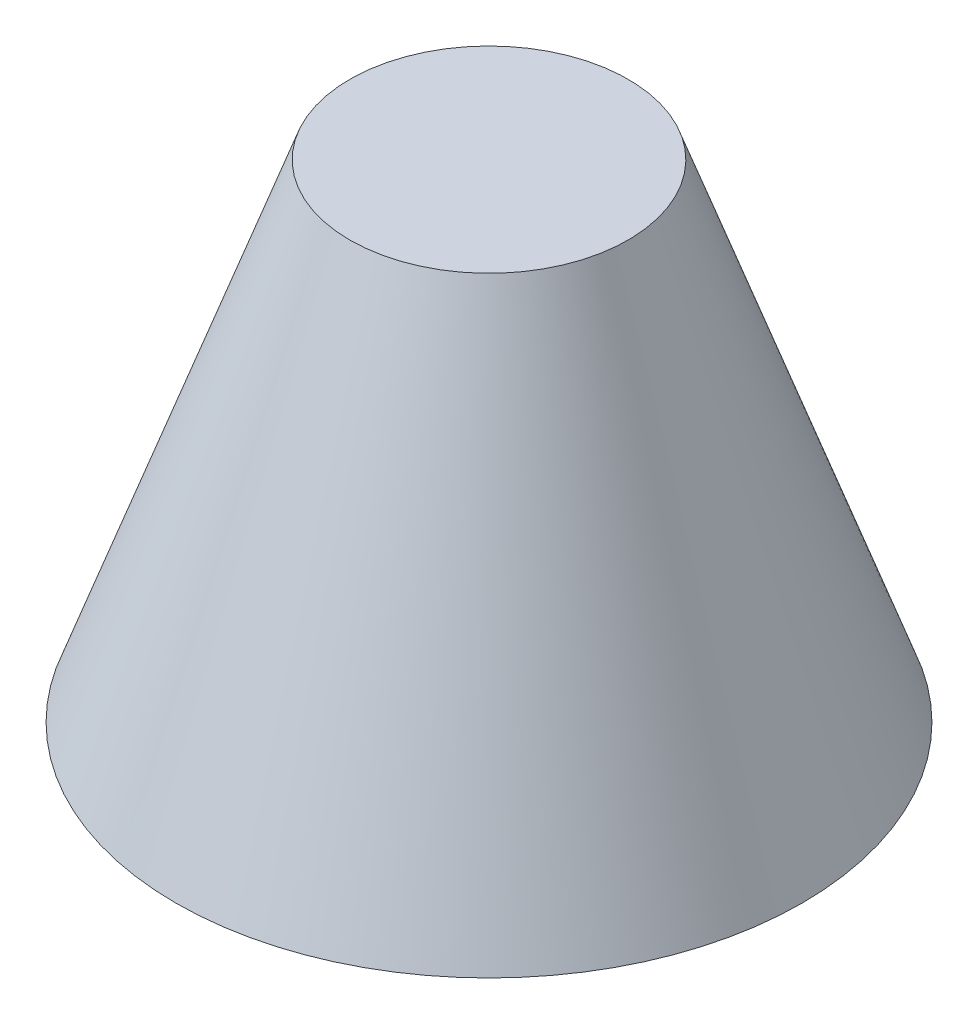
ISO-10303-21;
HEADER;
FILE_DESCRIPTION(('STEP AP214'),'2;1');
FILE_NAME('part.step','',(''),(''),'','','');
FILE_SCHEMA(('AUTOMOTIVE_DESIGN { 1 0 10303 214 1 1 1 1 }'));
ENDSEC;
DATA;
#1=APPLICATION_CONTEXT('core data for automotive mechanical design processes');
#2=APPLICATION_PROTOCOL_DEFINITION('international standard','automotive_design',2000,#1);
#3=PRODUCT_CONTEXT('',#1,'mechanical');
#4=PRODUCT('Part','Part','',(#3));
#5=PRODUCT_RELATED_PRODUCT_CATEGORY('part','',(#4));
#6=PRODUCT_DEFINITION_FORMATION('','',#4);
#7=PRODUCT_DEFINITION_CONTEXT('part definition',#1,'design');
#8=PRODUCT_DEFINITION('design','',#6,#7);
#9=PRODUCT_DEFINITION_SHAPE('','',#8);
#10=(LENGTH_UNIT() NAMED_UNIT(*) SI_UNIT(.MILLI.,.METRE.));
#11=(NAMED_UNIT(*) PLANE_ANGLE_UNIT() SI_UNIT($,.RADIAN.));
#12=(NAMED_UNIT(*) SI_UNIT($,.STERADIAN.) SOLID_ANGLE_UNIT());
#13=UNCERTAINTY_MEASURE_WITH_UNIT(LENGTH_MEASURE(1.E-05),#10,'distance_accuracy_value','');
#14=(GEOMETRIC_REPRESENTATION_CONTEXT(3) GLOBAL_UNCERTAINTY_ASSIGNED_CONTEXT((#13)) GLOBAL_UNIT_ASSIGNED_CONTEXT((#10,
#11,#12)) REPRESENTATION_CONTEXT('',''));
#15=CARTESIAN_POINT('',(0.,0.,0.));
#16=DIRECTION('',(0.,0.,1.));
#17=DIRECTION('',(1.,0.,0.));
#18=AXIS2_PLACEMENT_3D('',#15,#16,#17);
#19=CARTESIAN_POINT('',(0.,70.,0.));
#20=DIRECTION('',(0.,-1.,0.));
#21=DIRECTION('',(0.,0.,-1.));
#22=AXIS2_PLACEMENT_3D('',#19,#20,#21);
#23=PLANE('',#22);
#24=CARTESIAN_POINT('',(0.,70.,0.));
#25=DIRECTION('',(0.,1.,0.));
#26=DIRECTION('',(0.,0.,1.));
#27=AXIS2_PLACEMENT_3D('',#24,#25,#26);
#28=CIRCLE('',#27,20.);
#29=CARTESIAN_POINT('',(0.,70.,20.));
#30=VERTEX_POINT('',#29);
#31=EDGE_CURVE('E10',#30,#30,#28,.T.);
#32=ORIENTED_EDGE('',*,*,#31,.T.);
#33=EDGE_LOOP('',(#32));
#34=FACE_BOUND('',#33,.T.);
#35=ADVANCED_FACE('F35',(#34),#23,.F.);
#36=CARTESIAN_POINT('',(0.,0.,0.));
#37=DIRECTION('',(0.,-1.,0.));
#38=DIRECTION('',(0.,0.,-1.));
#39=AXIS2_PLACEMENT_3D('',#36,#37,#38);
#40=CONICAL_SURFACE('',#39,45.,0.343023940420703);
#41=ORIENTED_EDGE('',*,*,#31,.F.);
#42=EDGE_LOOP('',(#41));
#43=FACE_BOUND('',#42,.T.);
#44=CARTESIAN_POINT('',(0.,0.,0.));
#45=DIRECTION('',(0.,1.,0.));
#46=DIRECTION('',(0.,0.,1.));
#47=AXIS2_PLACEMENT_3D('',#44,#45,#46);
#48=CIRCLE('',#47,45.);
#49=CARTESIAN_POINT('',(0.,0.,45.));
#50=VERTEX_POINT('',#49);
#51=EDGE_CURVE('E41',#50,#50,#48,.T.);
#52=ORIENTED_EDGE('',*,*,#51,.T.);
#53=EDGE_LOOP('',(#52));
#54=FACE_BOUND('',#53,.T.);
#55=ADVANCED_FACE('F47',(#43,#54),#40,.T.);
#56=CARTESIAN_POINT('',(0.,0.,-45.));
#57=DIRECTION('',(0.,1.,0.));
#58=DIRECTION('',(0.,0.,1.));
#59=AXIS2_PLACEMENT_3D('',#56,#57,#58);
#60=PLANE('',#59);
#61=ORIENTED_EDGE('',*,*,#51,.F.);
#62=EDGE_LOOP('',(#61));
#63=FACE_BOUND('',#62,.T.);
#64=ADVANCED_FACE('F49',(#63),#60,.F.);
#65=CLOSED_SHELL('',(#35,#55,#64));
#66=MANIFOLD_SOLID_BREP('B2',#65);
#67=ADVANCED_BREP_SHAPE_REPRESENTATION('',(#18,#66),#14);
#68=SHAPE_DEFINITION_REPRESENTATION(#9,#67);
ENDSEC;
END-ISO-10303-21;
